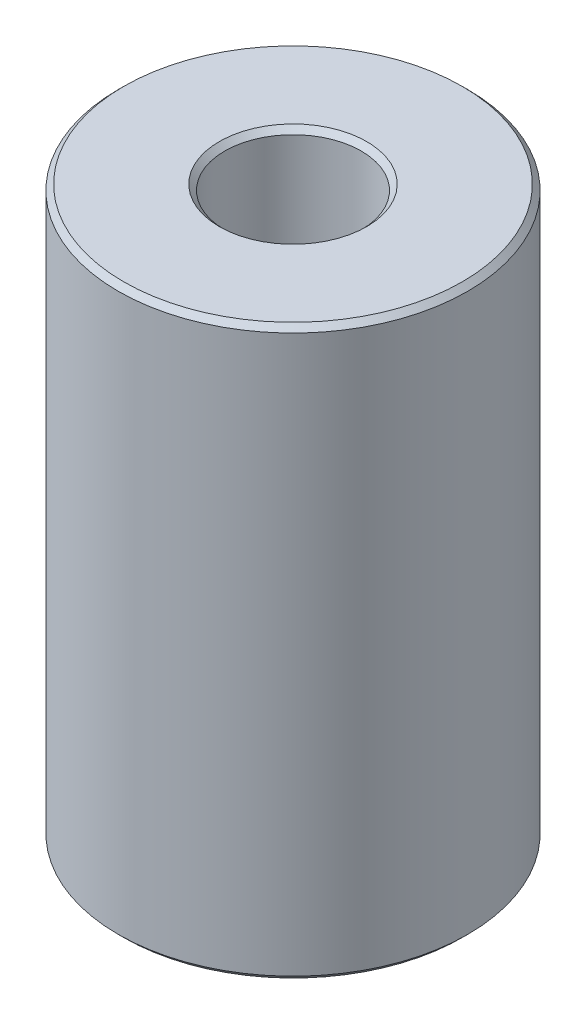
from build123d import *

# Parameters (mm, degrees)
ESQUISSE1_R        = 16
ESQUISSE1_R_2      = 6.25
BOSS_EXTRU_1_DEPTH = 52
CHANFREIN1_SIZE    = 0.5


with BuildPart() as part:
    # Esquisse1 → Boss.-Extru.1 (new body)
    with BuildSketch(Plane(origin=(0, 0, 0), x_dir=(1, 0, 0), z_dir=(0, 1, 0))):
        with Locations(Location((0, 0, 0), (0, 0, 90))):
            Circle(ESQUISSE1_R)
        with Locations(Location((0, 0, 0), (0, 0, 90))):
            Circle(ESQUISSE1_R_2, mode=Mode.SUBTRACT)
    extrude(amount=BOSS_EXTRU_1_DEPTH)

    # Chanfrein1
    chanfrein1_edges = [part.edges().sort_by_distance(p)[0] for p in [
        (0, 0, 16),
        (0, 52, 16),
        (0, 0, 6.25),
        (0, 52, 6.25),
    ]]
    chamfer(chanfrein1_edges, length=CHANFREIN1_SIZE)


solid = part.part
